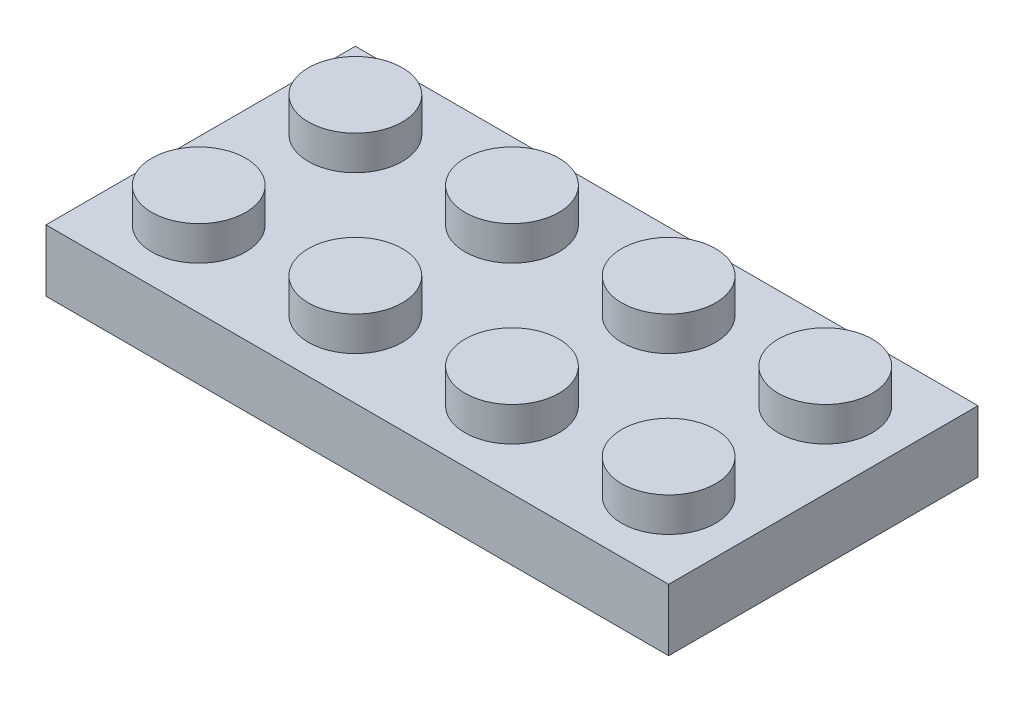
ISO-10303-21;
HEADER;
FILE_DESCRIPTION(('STEP AP214'),'2;1');
FILE_NAME('part.step','',(''),(''),'','','');
FILE_SCHEMA(('AUTOMOTIVE_DESIGN { 1 0 10303 214 1 1 1 1 }'));
ENDSEC;
DATA;
#1=APPLICATION_CONTEXT('core data for automotive mechanical design processes');
#2=APPLICATION_PROTOCOL_DEFINITION('international standard','automotive_design',2000,#1);
#3=PRODUCT_CONTEXT('',#1,'mechanical');
#4=PRODUCT('Part','Part','',(#3));
#5=PRODUCT_RELATED_PRODUCT_CATEGORY('part','',(#4));
#6=PRODUCT_DEFINITION_FORMATION('','',#4);
#7=PRODUCT_DEFINITION_CONTEXT('part definition',#1,'design');
#8=PRODUCT_DEFINITION('design','',#6,#7);
#9=PRODUCT_DEFINITION_SHAPE('','',#8);
#10=(LENGTH_UNIT() NAMED_UNIT(*) SI_UNIT(.MILLI.,.METRE.));
#11=(NAMED_UNIT(*) PLANE_ANGLE_UNIT() SI_UNIT($,.RADIAN.));
#12=(NAMED_UNIT(*) SI_UNIT($,.STERADIAN.) SOLID_ANGLE_UNIT());
#13=UNCERTAINTY_MEASURE_WITH_UNIT(LENGTH_MEASURE(1.E-05),#10,'distance_accuracy_value','');
#14=(GEOMETRIC_REPRESENTATION_CONTEXT(3) GLOBAL_UNCERTAINTY_ASSIGNED_CONTEXT((#13)) GLOBAL_UNIT_ASSIGNED_CONTEXT((#10,
#11,#12)) REPRESENTATION_CONTEXT('',''));
#15=CARTESIAN_POINT('',(0.,0.,0.));
#16=DIRECTION('',(0.,0.,1.));
#17=DIRECTION('',(1.,0.,0.));
#18=AXIS2_PLACEMENT_3D('',#15,#16,#17);
#19=CARTESIAN_POINT('',(-15.4,2.5,7.4));
#20=DIRECTION('',(0.,-1.,0.));
#21=DIRECTION('',(0.,0.,-1.));
#22=AXIS2_PLACEMENT_3D('',#19,#20,#21);
#23=PLANE('',#22);
#24=CARTESIAN_POINT('',(-0.100000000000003,2.5,0.));
#25=DIRECTION('',(0.,-1.,0.));
#26=DIRECTION('',(0.,0.,-1.));
#27=AXIS2_PLACEMENT_3D('',#24,#25,#26);
#28=CIRCLE('',#27,3.4);
#29=CARTESIAN_POINT('',(-0.100000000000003,2.5,-3.4));
#30=VERTEX_POINT('',#29);
#31=EDGE_CURVE('E364',#30,#30,#28,.T.);
#32=ORIENTED_EDGE('',*,*,#31,.F.);
#33=EDGE_LOOP('',(#32));
#34=FACE_BOUND('',#33,.T.);
#35=DIRECTION('',(0.,0.,-1.));
#36=VECTOR('',#35,1.);
#37=CARTESIAN_POINT('',(-15.4,2.5,-7.4));
#38=LINE('',#37,#36);
#39=CARTESIAN_POINT('',(-15.4,2.5,7.4));
#40=VERTEX_POINT('',#39);
#41=CARTESIAN_POINT('',(-15.4,2.5,-7.4));
#42=VERTEX_POINT('',#41);
#43=EDGE_CURVE('E114',#40,#42,#38,.T.);
#44=ORIENTED_EDGE('',*,*,#43,.T.);
#45=DIRECTION('',(1.,0.,0.));
#46=VECTOR('',#45,1.);
#47=CARTESIAN_POINT('',(15.4,2.5,-7.4));
#48=LINE('',#47,#46);
#49=CARTESIAN_POINT('',(15.4,2.5,-7.4));
#50=VERTEX_POINT('',#49);
#51=EDGE_CURVE('E123',#42,#50,#48,.T.);
#52=ORIENTED_EDGE('',*,*,#51,.T.);
#53=DIRECTION('',(0.,0.,1.));
#54=VECTOR('',#53,1.);
#55=CARTESIAN_POINT('',(15.4,2.5,-7.4));
#56=LINE('',#55,#54);
#57=CARTESIAN_POINT('',(15.4,2.5,7.4));
#58=VERTEX_POINT('',#57);
#59=EDGE_CURVE('E128',#50,#58,#56,.T.);
#60=ORIENTED_EDGE('',*,*,#59,.T.);
#61=DIRECTION('',(-1.,0.,0.));
#62=VECTOR('',#61,1.);
#63=CARTESIAN_POINT('',(15.4,2.5,7.4));
#64=LINE('',#63,#62);
#65=EDGE_CURVE('E120',#58,#40,#64,.T.);
#66=ORIENTED_EDGE('',*,*,#65,.T.);
#67=EDGE_LOOP('',(#44,#52,#60,#66));
#68=FACE_BOUND('',#67,.T.);
#69=CARTESIAN_POINT('',(7.9,2.5,0.));
#70=DIRECTION('',(0.,-1.,0.));
#71=DIRECTION('',(0.,0.,-1.));
#72=AXIS2_PLACEMENT_3D('',#69,#70,#71);
#73=CIRCLE('',#72,3.4);
#74=CARTESIAN_POINT('',(7.9,2.5,-3.4));
#75=VERTEX_POINT('',#74);
#76=EDGE_CURVE('E138',#75,#75,#73,.T.);
#77=ORIENTED_EDGE('',*,*,#76,.F.);
#78=EDGE_LOOP('',(#77));
#79=FACE_BOUND('',#78,.T.);
#80=CARTESIAN_POINT('',(-8.1,2.5,0.));
#81=DIRECTION('',(0.,-1.,0.));
#82=DIRECTION('',(0.,0.,-1.));
#83=AXIS2_PLACEMENT_3D('',#80,#81,#82);
#84=CIRCLE('',#83,3.4);
#85=CARTESIAN_POINT('',(-8.1,2.5,-3.4));
#86=VERTEX_POINT('',#85);
#87=EDGE_CURVE('E380',#86,#86,#84,.T.);
#88=ORIENTED_EDGE('',*,*,#87,.F.);
#89=EDGE_LOOP('',(#88));
#90=FACE_BOUND('',#89,.T.);
#91=ADVANCED_FACE('F37',(#34,#68,#79,#90),#23,.T.);
#92=CARTESIAN_POINT('',(-15.9,3.16,-7.9));
#93=DIRECTION('',(0.,1.,0.));
#94=DIRECTION('',(0.,0.,1.));
#95=AXIS2_PLACEMENT_3D('',#92,#93,#94);
#96=PLANE('',#95);
#97=CARTESIAN_POINT('',(-12.,3.16,4.));
#98=DIRECTION('',(0.,1.,0.));
#99=DIRECTION('',(0.,0.,1.));
#100=AXIS2_PLACEMENT_3D('',#97,#98,#99);
#101=CIRCLE('',#100,2.4);
#102=CARTESIAN_POINT('',(-12.,3.16,6.4));
#103=VERTEX_POINT('',#102);
#104=EDGE_CURVE('E195',#103,#103,#101,.T.);
#105=ORIENTED_EDGE('',*,*,#104,.F.);
#106=EDGE_LOOP('',(#105));
#107=FACE_BOUND('',#106,.T.);
#108=CARTESIAN_POINT('',(-4.00000000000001,3.16,4.));
#109=DIRECTION('',(0.,1.,0.));
#110=DIRECTION('',(0.,0.,1.));
#111=AXIS2_PLACEMENT_3D('',#108,#109,#110);
#112=CIRCLE('',#111,2.4);
#113=CARTESIAN_POINT('',(-4.00000000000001,3.16,6.4));
#114=VERTEX_POINT('',#113);
#115=EDGE_CURVE('E189',#114,#114,#112,.T.);
#116=ORIENTED_EDGE('',*,*,#115,.F.);
#117=EDGE_LOOP('',(#116));
#118=FACE_BOUND('',#117,.T.);
#119=CARTESIAN_POINT('',(3.99999999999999,3.16,4.));
#120=DIRECTION('',(0.,1.,0.));
#121=DIRECTION('',(0.,0.,1.));
#122=AXIS2_PLACEMENT_3D('',#119,#120,#121);
#123=CIRCLE('',#122,2.4);
#124=CARTESIAN_POINT('',(3.99999999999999,3.16,6.4));
#125=VERTEX_POINT('',#124);
#126=EDGE_CURVE('E362',#125,#125,#123,.T.);
#127=ORIENTED_EDGE('',*,*,#126,.F.);
#128=EDGE_LOOP('',(#127));
#129=FACE_BOUND('',#128,.T.);
#130=CARTESIAN_POINT('',(12.,3.16,-4.));
#131=DIRECTION('',(0.,1.,0.));
#132=DIRECTION('',(0.,0.,1.));
#133=AXIS2_PLACEMENT_3D('',#130,#131,#132);
#134=CIRCLE('',#133,2.4);
#135=CARTESIAN_POINT('',(12.,3.16,-1.6));
#136=VERTEX_POINT('',#135);
#137=EDGE_CURVE('E158',#136,#136,#134,.T.);
#138=ORIENTED_EDGE('',*,*,#137,.F.);
#139=EDGE_LOOP('',(#138));
#140=FACE_BOUND('',#139,.T.);
#141=DIRECTION('',(0.,0.,1.));
#142=VECTOR('',#141,1.);
#143=CARTESIAN_POINT('',(-15.9,3.16,7.9));
#144=LINE('',#143,#142);
#145=CARTESIAN_POINT('',(-15.9,3.16,-7.9));
#146=VERTEX_POINT('',#145);
#147=CARTESIAN_POINT('',(-15.9,3.16,7.9));
#148=VERTEX_POINT('',#147);
#149=EDGE_CURVE('E167',#146,#148,#144,.T.);
#150=ORIENTED_EDGE('',*,*,#149,.T.);
#151=DIRECTION('',(1.,0.,0.));
#152=VECTOR('',#151,1.);
#153=CARTESIAN_POINT('',(15.9,3.16,7.9));
#154=LINE('',#153,#152);
#155=CARTESIAN_POINT('',(15.9,3.16,7.9));
#156=VERTEX_POINT('',#155);
#157=EDGE_CURVE('E90',#148,#156,#154,.T.);
#158=ORIENTED_EDGE('',*,*,#157,.T.);
#159=DIRECTION('',(0.,0.,-1.));
#160=VECTOR('',#159,1.);
#161=CARTESIAN_POINT('',(15.9,3.16,7.9));
#162=LINE('',#161,#160);
#163=CARTESIAN_POINT('',(15.9,3.16,-7.9));
#164=VERTEX_POINT('',#163);
#165=EDGE_CURVE('E170',#156,#164,#162,.T.);
#166=ORIENTED_EDGE('',*,*,#165,.T.);
#167=DIRECTION('',(-1.,0.,0.));
#168=VECTOR('',#167,1.);
#169=CARTESIAN_POINT('',(15.9,3.16,-7.9));
#170=LINE('',#169,#168);
#171=EDGE_CURVE('E61',#164,#146,#170,.T.);
#172=ORIENTED_EDGE('',*,*,#171,.T.);
#173=EDGE_LOOP('',(#150,#158,#166,#172));
#174=FACE_BOUND('',#173,.T.);
#175=CARTESIAN_POINT('',(12.,3.16,4.));
#176=DIRECTION('',(0.,1.,0.));
#177=DIRECTION('',(0.,0.,1.));
#178=AXIS2_PLACEMENT_3D('',#175,#176,#177);
#179=CIRCLE('',#178,2.4);
#180=CARTESIAN_POINT('',(12.,3.16,6.4));
#181=VERTEX_POINT('',#180);
#182=EDGE_CURVE('E151',#181,#181,#179,.T.);
#183=ORIENTED_EDGE('',*,*,#182,.F.);
#184=EDGE_LOOP('',(#183));
#185=FACE_BOUND('',#184,.T.);
#186=CARTESIAN_POINT('',(3.99999999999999,3.16,-4.));
#187=DIRECTION('',(0.,1.,0.));
#188=DIRECTION('',(0.,0.,1.));
#189=AXIS2_PLACEMENT_3D('',#186,#187,#188);
#190=CIRCLE('',#189,2.4);
#191=CARTESIAN_POINT('',(3.99999999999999,3.16,-1.6));
#192=VERTEX_POINT('',#191);
#193=EDGE_CURVE('E354',#192,#192,#190,.T.);
#194=ORIENTED_EDGE('',*,*,#193,.F.);
#195=EDGE_LOOP('',(#194));
#196=FACE_BOUND('',#195,.T.);
#197=CARTESIAN_POINT('',(-4.00000000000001,3.16,-4.));
#198=DIRECTION('',(0.,1.,0.));
#199=DIRECTION('',(0.,0.,1.));
#200=AXIS2_PLACEMENT_3D('',#197,#198,#199);
#201=CIRCLE('',#200,2.4);
#202=CARTESIAN_POINT('',(-4.00000000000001,3.16,-1.6));
#203=VERTEX_POINT('',#202);
#204=EDGE_CURVE('E201',#203,#203,#201,.T.);
#205=ORIENTED_EDGE('',*,*,#204,.F.);
#206=EDGE_LOOP('',(#205));
#207=FACE_BOUND('',#206,.T.);
#208=CARTESIAN_POINT('',(-12.,3.16,-4.));
#209=DIRECTION('',(0.,1.,0.));
#210=DIRECTION('',(0.,0.,1.));
#211=AXIS2_PLACEMENT_3D('',#208,#209,#210);
#212=CIRCLE('',#211,2.4);
#213=CARTESIAN_POINT('',(-12.,3.16,-1.6));
#214=VERTEX_POINT('',#213);
#215=EDGE_CURVE('E45',#214,#214,#212,.T.);
#216=ORIENTED_EDGE('',*,*,#215,.F.);
#217=EDGE_LOOP('',(#216));
#218=FACE_BOUND('',#217,.T.);
#219=ADVANCED_FACE('F211',(#107,#118,#129,#140,#174,#185,#196,#207,#218),#96,.T.);
#220=CARTESIAN_POINT('',(-15.9,3.16,7.9));
#221=DIRECTION('',(1.,0.,0.));
#222=DIRECTION('',(0.,0.,-1.));
#223=AXIS2_PLACEMENT_3D('',#220,#221,#222);
#224=PLANE('',#223);
#225=DIRECTION('',(0.,0.,1.));
#226=VECTOR('',#225,1.);
#227=CARTESIAN_POINT('',(-15.9,0.,7.9));
#228=LINE('',#227,#226);
#229=CARTESIAN_POINT('',(-15.9,0.,-7.9));
#230=VERTEX_POINT('',#229);
#231=CARTESIAN_POINT('',(-15.9,0.,7.9));
#232=VERTEX_POINT('',#231);
#233=EDGE_CURVE('E164',#230,#232,#228,.T.);
#234=ORIENTED_EDGE('',*,*,#233,.T.);
#235=DIRECTION('',(0.,-1.,0.));
#236=VECTOR('',#235,1.);
#237=CARTESIAN_POINT('',(-15.9,3.16,7.9));
#238=LINE('',#237,#236);
#239=EDGE_CURVE('E187',#148,#232,#238,.T.);
#240=ORIENTED_EDGE('',*,*,#239,.F.);
#241=ORIENTED_EDGE('',*,*,#149,.F.);
#242=DIRECTION('',(0.,-1.,0.));
#243=VECTOR('',#242,1.);
#244=CARTESIAN_POINT('',(-15.9,3.16,-7.9));
#245=LINE('',#244,#243);
#246=EDGE_CURVE('E173',#146,#230,#245,.T.);
#247=ORIENTED_EDGE('',*,*,#246,.T.);
#248=EDGE_LOOP('',(#234,#240,#241,#247));
#249=FACE_BOUND('',#248,.T.);
#250=ADVANCED_FACE('F213',(#249),#224,.F.);
#251=CARTESIAN_POINT('',(15.9,3.16,7.9));
#252=DIRECTION('',(0.,0.,-1.));
#253=DIRECTION('',(-1.,0.,0.));
#254=AXIS2_PLACEMENT_3D('',#251,#252,#253);
#255=PLANE('',#254);
#256=DIRECTION('',(1.,0.,0.));
#257=VECTOR('',#256,1.);
#258=CARTESIAN_POINT('',(15.9,0.,7.9));
#259=LINE('',#258,#257);
#260=CARTESIAN_POINT('',(15.9,0.,7.9));
#261=VERTEX_POINT('',#260);
#262=EDGE_CURVE('E176',#232,#261,#259,.T.);
#263=ORIENTED_EDGE('',*,*,#262,.T.);
#264=DIRECTION('',(0.,-1.,0.));
#265=VECTOR('',#264,1.);
#266=CARTESIAN_POINT('',(15.9,3.16,7.9));
#267=LINE('',#266,#265);
#268=EDGE_CURVE('E184',#156,#261,#267,.T.);
#269=ORIENTED_EDGE('',*,*,#268,.F.);
#270=ORIENTED_EDGE('',*,*,#157,.F.);
#271=ORIENTED_EDGE('',*,*,#239,.T.);
#272=EDGE_LOOP('',(#263,#269,#270,#271));
#273=FACE_BOUND('',#272,.T.);
#274=ADVANCED_FACE('F220',(#273),#255,.F.);
#275=CARTESIAN_POINT('',(15.9,3.16,7.9));
#276=DIRECTION('',(-1.,0.,0.));
#277=DIRECTION('',(0.,0.,1.));
#278=AXIS2_PLACEMENT_3D('',#275,#276,#277);
#279=PLANE('',#278);
#280=DIRECTION('',(0.,0.,-1.));
#281=VECTOR('',#280,1.);
#282=CARTESIAN_POINT('',(15.9,0.,7.9));
#283=LINE('',#282,#281);
#284=CARTESIAN_POINT('',(15.9,0.,-7.9));
#285=VERTEX_POINT('',#284);
#286=EDGE_CURVE('E178',#261,#285,#283,.T.);
#287=ORIENTED_EDGE('',*,*,#286,.T.);
#288=DIRECTION('',(0.,-1.,0.));
#289=VECTOR('',#288,1.);
#290=CARTESIAN_POINT('',(15.9,3.16,-7.9));
#291=LINE('',#290,#289);
#292=EDGE_CURVE('E182',#164,#285,#291,.T.);
#293=ORIENTED_EDGE('',*,*,#292,.F.);
#294=ORIENTED_EDGE('',*,*,#165,.F.);
#295=ORIENTED_EDGE('',*,*,#268,.T.);
#296=EDGE_LOOP('',(#287,#293,#294,#295));
#297=FACE_BOUND('',#296,.T.);
#298=ADVANCED_FACE('F238',(#297),#279,.F.);
#299=CARTESIAN_POINT('',(15.9,3.16,-7.9));
#300=DIRECTION('',(0.,0.,1.));
#301=DIRECTION('',(1.,0.,0.));
#302=AXIS2_PLACEMENT_3D('',#299,#300,#301);
#303=PLANE('',#302);
#304=DIRECTION('',(-1.,0.,0.));
#305=VECTOR('',#304,1.);
#306=CARTESIAN_POINT('',(15.9,0.,-7.9));
#307=LINE('',#306,#305);
#308=EDGE_CURVE('E82',#285,#230,#307,.T.);
#309=ORIENTED_EDGE('',*,*,#308,.T.);
#310=ORIENTED_EDGE('',*,*,#246,.F.);
#311=ORIENTED_EDGE('',*,*,#171,.F.);
#312=ORIENTED_EDGE('',*,*,#292,.T.);
#313=EDGE_LOOP('',(#309,#310,#311,#312));
#314=FACE_BOUND('',#313,.T.);
#315=ADVANCED_FACE('F234',(#314),#303,.F.);
#316=CARTESIAN_POINT('',(-15.9,0.,-7.9));
#317=DIRECTION('',(0.,1.,0.));
#318=DIRECTION('',(0.,0.,1.));
#319=AXIS2_PLACEMENT_3D('',#316,#317,#318);
#320=PLANE('',#319);
#321=DIRECTION('',(1.,0.,0.));
#322=VECTOR('',#321,1.);
#323=CARTESIAN_POINT('',(15.4,0.,-7.4));
#324=LINE('',#323,#322);
#325=CARTESIAN_POINT('',(-15.4,0.,-7.4));
#326=VERTEX_POINT('',#325);
#327=CARTESIAN_POINT('',(15.4,0.,-7.4));
#328=VERTEX_POINT('',#327);
#329=EDGE_CURVE('E144',#326,#328,#324,.T.);
#330=ORIENTED_EDGE('',*,*,#329,.F.);
#331=DIRECTION('',(0.,0.,-1.));
#332=VECTOR('',#331,1.);
#333=CARTESIAN_POINT('',(-15.4,0.,-7.4));
#334=LINE('',#333,#332);
#335=CARTESIAN_POINT('',(-15.4,0.,7.4));
#336=VERTEX_POINT('',#335);
#337=EDGE_CURVE('E52',#336,#326,#334,.T.);
#338=ORIENTED_EDGE('',*,*,#337,.F.);
#339=DIRECTION('',(-1.,0.,0.));
#340=VECTOR('',#339,1.);
#341=CARTESIAN_POINT('',(15.4,0.,7.4));
#342=LINE('',#341,#340);
#343=CARTESIAN_POINT('',(15.4,0.,7.4));
#344=VERTEX_POINT('',#343);
#345=EDGE_CURVE('E132',#344,#336,#342,.T.);
#346=ORIENTED_EDGE('',*,*,#345,.F.);
#347=DIRECTION('',(0.,0.,1.));
#348=VECTOR('',#347,1.);
#349=CARTESIAN_POINT('',(15.4,0.,-7.4));
#350=LINE('',#349,#348);
#351=EDGE_CURVE('E135',#328,#344,#350,.T.);
#352=ORIENTED_EDGE('',*,*,#351,.F.);
#353=EDGE_LOOP('',(#330,#338,#346,#352));
#354=FACE_BOUND('',#353,.T.);
#355=ORIENTED_EDGE('',*,*,#233,.F.);
#356=ORIENTED_EDGE('',*,*,#308,.F.);
#357=ORIENTED_EDGE('',*,*,#286,.F.);
#358=ORIENTED_EDGE('',*,*,#262,.F.);
#359=EDGE_LOOP('',(#355,#356,#357,#358));
#360=FACE_BOUND('',#359,.T.);
#361=ADVANCED_FACE('F231',(#354,#360),#320,.F.);
#362=CARTESIAN_POINT('',(12.,4.91,-4.));
#363=DIRECTION('',(0.,-1.,0.));
#364=DIRECTION('',(0.,0.,-1.));
#365=AXIS2_PLACEMENT_3D('',#362,#363,#364);
#366=CYLINDRICAL_SURFACE('',#365,2.4);
#367=CARTESIAN_POINT('',(12.,4.91,-4.));
#368=DIRECTION('',(0.,1.,0.));
#369=DIRECTION('',(0.,0.,1.));
#370=AXIS2_PLACEMENT_3D('',#367,#368,#369);
#371=CIRCLE('',#370,2.4);
#372=CARTESIAN_POINT('',(12.,4.91,-1.6));
#373=VERTEX_POINT('',#372);
#374=EDGE_CURVE('E161',#373,#373,#371,.T.);
#375=ORIENTED_EDGE('',*,*,#374,.F.);
#376=EDGE_LOOP('',(#375));
#377=FACE_BOUND('',#376,.T.);
#378=ORIENTED_EDGE('',*,*,#137,.T.);
#379=EDGE_LOOP('',(#378));
#380=FACE_BOUND('',#379,.T.);
#381=ADVANCED_FACE('F229',(#377,#380),#366,.T.);
#382=CARTESIAN_POINT('',(12.,4.91,-4.));
#383=DIRECTION('',(0.,1.,0.));
#384=DIRECTION('',(0.,0.,1.));
#385=AXIS2_PLACEMENT_3D('',#382,#383,#384);
#386=PLANE('',#385);
#387=ORIENTED_EDGE('',*,*,#374,.T.);
#388=EDGE_LOOP('',(#387));
#389=FACE_BOUND('',#388,.T.);
#390=ADVANCED_FACE('F334',(#389),#386,.T.);
#391=CARTESIAN_POINT('',(12.,4.91,4.));
#392=DIRECTION('',(0.,-1.,0.));
#393=DIRECTION('',(0.,0.,-1.));
#394=AXIS2_PLACEMENT_3D('',#391,#392,#393);
#395=CYLINDRICAL_SURFACE('',#394,2.4);
#396=CARTESIAN_POINT('',(12.,4.91,4.));
#397=DIRECTION('',(0.,1.,0.));
#398=DIRECTION('',(0.,0.,1.));
#399=AXIS2_PLACEMENT_3D('',#396,#397,#398);
#400=CIRCLE('',#399,2.4);
#401=CARTESIAN_POINT('',(12.,4.91,6.4));
#402=VERTEX_POINT('',#401);
#403=EDGE_CURVE('E155',#402,#402,#400,.T.);
#404=ORIENTED_EDGE('',*,*,#403,.F.);
#405=EDGE_LOOP('',(#404));
#406=FACE_BOUND('',#405,.T.);
#407=ORIENTED_EDGE('',*,*,#182,.T.);
#408=EDGE_LOOP('',(#407));
#409=FACE_BOUND('',#408,.T.);
#410=ADVANCED_FACE('F331',(#406,#409),#395,.T.);
#411=CARTESIAN_POINT('',(12.,4.91,4.));
#412=DIRECTION('',(0.,1.,0.));
#413=DIRECTION('',(0.,0.,1.));
#414=AXIS2_PLACEMENT_3D('',#411,#412,#413);
#415=PLANE('',#414);
#416=ORIENTED_EDGE('',*,*,#403,.T.);
#417=EDGE_LOOP('',(#416));
#418=FACE_BOUND('',#417,.T.);
#419=ADVANCED_FACE('F328',(#418),#415,.T.);
#420=CARTESIAN_POINT('',(-15.4,2.5,-7.4));
#421=DIRECTION('',(-1.,0.,0.));
#422=DIRECTION('',(0.,0.,1.));
#423=AXIS2_PLACEMENT_3D('',#420,#421,#422);
#424=PLANE('',#423);
#425=ORIENTED_EDGE('',*,*,#337,.T.);
#426=DIRECTION('',(0.,-1.,0.));
#427=VECTOR('',#426,1.);
#428=CARTESIAN_POINT('',(-15.4,2.5,-7.4));
#429=LINE('',#428,#427);
#430=EDGE_CURVE('E110',#42,#326,#429,.T.);
#431=ORIENTED_EDGE('',*,*,#430,.F.);
#432=ORIENTED_EDGE('',*,*,#43,.F.);
#433=DIRECTION('',(0.,-1.,0.));
#434=VECTOR('',#433,1.);
#435=CARTESIAN_POINT('',(-15.4,2.5,7.4));
#436=LINE('',#435,#434);
#437=EDGE_CURVE('E149',#40,#336,#436,.T.);
#438=ORIENTED_EDGE('',*,*,#437,.T.);
#439=EDGE_LOOP('',(#425,#431,#432,#438));
#440=FACE_BOUND('',#439,.T.);
#441=ADVANCED_FACE('F112',(#440),#424,.F.);
#442=CARTESIAN_POINT('',(15.4,2.5,7.4));
#443=DIRECTION('',(0.,0.,1.));
#444=DIRECTION('',(1.,0.,0.));
#445=AXIS2_PLACEMENT_3D('',#442,#443,#444);
#446=PLANE('',#445);
#447=ORIENTED_EDGE('',*,*,#345,.T.);
#448=ORIENTED_EDGE('',*,*,#437,.F.);
#449=ORIENTED_EDGE('',*,*,#65,.F.);
#450=DIRECTION('',(0.,-1.,0.));
#451=VECTOR('',#450,1.);
#452=CARTESIAN_POINT('',(15.4,2.5,7.4));
#453=LINE('',#452,#451);
#454=EDGE_CURVE('E152',#58,#344,#453,.T.);
#455=ORIENTED_EDGE('',*,*,#454,.T.);
#456=EDGE_LOOP('',(#447,#448,#449,#455));
#457=FACE_BOUND('',#456,.T.);
#458=ADVANCED_FACE('F316',(#457),#446,.F.);
#459=CARTESIAN_POINT('',(15.4,2.5,-7.4));
#460=DIRECTION('',(1.,0.,0.));
#461=DIRECTION('',(0.,0.,-1.));
#462=AXIS2_PLACEMENT_3D('',#459,#460,#461);
#463=PLANE('',#462);
#464=ORIENTED_EDGE('',*,*,#351,.T.);
#465=ORIENTED_EDGE('',*,*,#454,.F.);
#466=ORIENTED_EDGE('',*,*,#59,.F.);
#467=DIRECTION('',(0.,-1.,0.));
#468=VECTOR('',#467,1.);
#469=CARTESIAN_POINT('',(15.4,2.5,-7.4));
#470=LINE('',#469,#468);
#471=EDGE_CURVE('E119',#50,#328,#470,.T.);
#472=ORIENTED_EDGE('',*,*,#471,.T.);
#473=EDGE_LOOP('',(#464,#465,#466,#472));
#474=FACE_BOUND('',#473,.T.);
#475=ADVANCED_FACE('F319',(#474),#463,.F.);
#476=CARTESIAN_POINT('',(15.4,2.5,-7.4));
#477=DIRECTION('',(0.,0.,-1.));
#478=DIRECTION('',(-1.,0.,0.));
#479=AXIS2_PLACEMENT_3D('',#476,#477,#478);
#480=PLANE('',#479);
#481=ORIENTED_EDGE('',*,*,#329,.T.);
#482=ORIENTED_EDGE('',*,*,#471,.F.);
#483=ORIENTED_EDGE('',*,*,#51,.F.);
#484=ORIENTED_EDGE('',*,*,#430,.T.);
#485=EDGE_LOOP('',(#481,#482,#483,#484));
#486=FACE_BOUND('',#485,.T.);
#487=ADVANCED_FACE('F124',(#486),#480,.F.);
#488=CARTESIAN_POINT('',(7.9,0.,0.));
#489=DIRECTION('',(0.,1.,0.));
#490=DIRECTION('',(0.,0.,1.));
#491=AXIS2_PLACEMENT_3D('',#488,#489,#490);
#492=CYLINDRICAL_SURFACE('',#491,3.4);
#493=CARTESIAN_POINT('',(7.9,0.,0.));
#494=DIRECTION('',(0.,-1.,0.));
#495=DIRECTION('',(0.,0.,-1.));
#496=AXIS2_PLACEMENT_3D('',#493,#494,#495);
#497=CIRCLE('',#496,3.4);
#498=CARTESIAN_POINT('',(7.9,0.,-3.4));
#499=VERTEX_POINT('',#498);
#500=EDGE_CURVE('E145',#499,#499,#497,.T.);
#501=ORIENTED_EDGE('',*,*,#500,.F.);
#502=EDGE_LOOP('',(#501));
#503=FACE_BOUND('',#502,.T.);
#504=ORIENTED_EDGE('',*,*,#76,.T.);
#505=EDGE_LOOP('',(#504));
#506=FACE_BOUND('',#505,.T.);
#507=ADVANCED_FACE('F311',(#503,#506),#492,.T.);
#508=CARTESIAN_POINT('',(7.9,0.,0.));
#509=DIRECTION('',(0.,-1.,0.));
#510=DIRECTION('',(0.,0.,-1.));
#511=AXIS2_PLACEMENT_3D('',#508,#509,#510);
#512=PLANE('',#511);
#513=ORIENTED_EDGE('',*,*,#500,.T.);
#514=EDGE_LOOP('',(#513));
#515=FACE_BOUND('',#514,.T.);
#516=ADVANCED_FACE('F305',(#515),#512,.T.);
#517=CARTESIAN_POINT('',(3.99999999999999,4.91,4.));
#518=DIRECTION('',(0.,-1.,0.));
#519=DIRECTION('',(0.,0.,-1.));
#520=AXIS2_PLACEMENT_3D('',#517,#518,#519);
#521=CYLINDRICAL_SURFACE('',#520,2.4);
#522=CARTESIAN_POINT('',(3.99999999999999,4.91,4.));
#523=DIRECTION('',(0.,1.,0.));
#524=DIRECTION('',(0.,0.,1.));
#525=AXIS2_PLACEMENT_3D('',#522,#523,#524);
#526=CIRCLE('',#525,2.4);
#527=CARTESIAN_POINT('',(3.99999999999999,4.91,6.4));
#528=VERTEX_POINT('',#527);
#529=EDGE_CURVE('E370',#528,#528,#526,.T.);
#530=ORIENTED_EDGE('',*,*,#529,.F.);
#531=EDGE_LOOP('',(#530));
#532=FACE_BOUND('',#531,.T.);
#533=ORIENTED_EDGE('',*,*,#126,.T.);
#534=EDGE_LOOP('',(#533));
#535=FACE_BOUND('',#534,.T.);
#536=ADVANCED_FACE('F254',(#532,#535),#521,.T.);
#537=CARTESIAN_POINT('',(3.99999999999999,4.91,4.));
#538=DIRECTION('',(0.,1.,0.));
#539=DIRECTION('',(0.,0.,1.));
#540=AXIS2_PLACEMENT_3D('',#537,#538,#539);
#541=PLANE('',#540);
#542=ORIENTED_EDGE('',*,*,#529,.T.);
#543=EDGE_LOOP('',(#542));
#544=FACE_BOUND('',#543,.T.);
#545=ADVANCED_FACE('F252',(#544),#541,.T.);
#546=CARTESIAN_POINT('',(-4.00000000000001,4.91,4.));
#547=DIRECTION('',(0.,1.,0.));
#548=DIRECTION('',(0.,0.,1.));
#549=AXIS2_PLACEMENT_3D('',#546,#547,#548);
#550=PLANE('',#549);
#551=CARTESIAN_POINT('',(-4.00000000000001,4.91,4.));
#552=DIRECTION('',(0.,1.,0.));
#553=DIRECTION('',(0.,0.,1.));
#554=AXIS2_PLACEMENT_3D('',#551,#552,#553);
#555=CIRCLE('',#554,2.4);
#556=CARTESIAN_POINT('',(-4.00000000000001,4.91,6.4));
#557=VERTEX_POINT('',#556);
#558=EDGE_CURVE('E192',#557,#557,#555,.T.);
#559=ORIENTED_EDGE('',*,*,#558,.T.);
#560=EDGE_LOOP('',(#559));
#561=FACE_BOUND('',#560,.T.);
#562=ADVANCED_FACE('F248',(#561),#550,.T.);
#563=CARTESIAN_POINT('',(-4.00000000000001,4.91,4.));
#564=DIRECTION('',(0.,-1.,0.));
#565=DIRECTION('',(0.,0.,-1.));
#566=AXIS2_PLACEMENT_3D('',#563,#564,#565);
#567=CYLINDRICAL_SURFACE('',#566,2.4);
#568=ORIENTED_EDGE('',*,*,#558,.F.);
#569=EDGE_LOOP('',(#568));
#570=FACE_BOUND('',#569,.T.);
#571=ORIENTED_EDGE('',*,*,#115,.T.);
#572=EDGE_LOOP('',(#571));
#573=FACE_BOUND('',#572,.T.);
#574=ADVANCED_FACE('F244',(#570,#573),#567,.T.);
#575=CARTESIAN_POINT('',(-12.,4.91,4.));
#576=DIRECTION('',(0.,1.,0.));
#577=DIRECTION('',(0.,0.,1.));
#578=AXIS2_PLACEMENT_3D('',#575,#576,#577);
#579=PLANE('',#578);
#580=CARTESIAN_POINT('',(-12.,4.91,4.));
#581=DIRECTION('',(0.,1.,0.));
#582=DIRECTION('',(0.,0.,1.));
#583=AXIS2_PLACEMENT_3D('',#580,#581,#582);
#584=CIRCLE('',#583,2.4);
#585=CARTESIAN_POINT('',(-12.,4.91,6.4));
#586=VERTEX_POINT('',#585);
#587=EDGE_CURVE('E198',#586,#586,#584,.T.);
#588=ORIENTED_EDGE('',*,*,#587,.T.);
#589=EDGE_LOOP('',(#588));
#590=FACE_BOUND('',#589,.T.);
#591=ADVANCED_FACE('F247',(#590),#579,.T.);
#592=CARTESIAN_POINT('',(-12.,4.91,4.));
#593=DIRECTION('',(0.,-1.,0.));
#594=DIRECTION('',(0.,0.,-1.));
#595=AXIS2_PLACEMENT_3D('',#592,#593,#594);
#596=CYLINDRICAL_SURFACE('',#595,2.4);
#597=ORIENTED_EDGE('',*,*,#587,.F.);
#598=EDGE_LOOP('',(#597));
#599=FACE_BOUND('',#598,.T.);
#600=ORIENTED_EDGE('',*,*,#104,.T.);
#601=EDGE_LOOP('',(#600));
#602=FACE_BOUND('',#601,.T.);
#603=ADVANCED_FACE('F255',(#599,#602),#596,.T.);
#604=CARTESIAN_POINT('',(3.99999999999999,4.91,-4.));
#605=DIRECTION('',(0.,-1.,0.));
#606=DIRECTION('',(0.,0.,-1.));
#607=AXIS2_PLACEMENT_3D('',#604,#605,#606);
#608=CYLINDRICAL_SURFACE('',#607,2.4);
#609=CARTESIAN_POINT('',(3.99999999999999,4.91,-4.));
#610=DIRECTION('',(0.,1.,0.));
#611=DIRECTION('',(0.,0.,1.));
#612=AXIS2_PLACEMENT_3D('',#609,#610,#611);
#613=CIRCLE('',#612,2.4);
#614=CARTESIAN_POINT('',(3.99999999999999,4.91,-1.6));
#615=VERTEX_POINT('',#614);
#616=EDGE_CURVE('E358',#615,#615,#613,.T.);
#617=ORIENTED_EDGE('',*,*,#616,.F.);
#618=EDGE_LOOP('',(#617));
#619=FACE_BOUND('',#618,.T.);
#620=ORIENTED_EDGE('',*,*,#193,.T.);
#621=EDGE_LOOP('',(#620));
#622=FACE_BOUND('',#621,.T.);
#623=ADVANCED_FACE('F258',(#619,#622),#608,.T.);
#624=CARTESIAN_POINT('',(3.99999999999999,4.91,-4.));
#625=DIRECTION('',(0.,1.,0.));
#626=DIRECTION('',(0.,0.,1.));
#627=AXIS2_PLACEMENT_3D('',#624,#625,#626);
#628=PLANE('',#627);
#629=ORIENTED_EDGE('',*,*,#616,.T.);
#630=EDGE_LOOP('',(#629));
#631=FACE_BOUND('',#630,.T.);
#632=ADVANCED_FACE('F260',(#631),#628,.T.);
#633=CARTESIAN_POINT('',(-4.00000000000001,4.91,-4.));
#634=DIRECTION('',(0.,1.,0.));
#635=DIRECTION('',(0.,0.,1.));
#636=AXIS2_PLACEMENT_3D('',#633,#634,#635);
#637=PLANE('',#636);
#638=CARTESIAN_POINT('',(-4.00000000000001,4.91,-4.));
#639=DIRECTION('',(0.,1.,0.));
#640=DIRECTION('',(0.,0.,1.));
#641=AXIS2_PLACEMENT_3D('',#638,#639,#640);
#642=CIRCLE('',#641,2.4);
#643=CARTESIAN_POINT('',(-4.00000000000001,4.91,-1.6));
#644=VERTEX_POINT('',#643);
#645=EDGE_CURVE('E204',#644,#644,#642,.T.);
#646=ORIENTED_EDGE('',*,*,#645,.T.);
#647=EDGE_LOOP('',(#646));
#648=FACE_BOUND('',#647,.T.);
#649=ADVANCED_FACE('F267',(#648),#637,.T.);
#650=CARTESIAN_POINT('',(-4.00000000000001,4.91,-4.));
#651=DIRECTION('',(0.,-1.,0.));
#652=DIRECTION('',(0.,0.,-1.));
#653=AXIS2_PLACEMENT_3D('',#650,#651,#652);
#654=CYLINDRICAL_SURFACE('',#653,2.4);
#655=ORIENTED_EDGE('',*,*,#645,.F.);
#656=EDGE_LOOP('',(#655));
#657=FACE_BOUND('',#656,.T.);
#658=ORIENTED_EDGE('',*,*,#204,.T.);
#659=EDGE_LOOP('',(#658));
#660=FACE_BOUND('',#659,.T.);
#661=ADVANCED_FACE('F264',(#657,#660),#654,.T.);
#662=CARTESIAN_POINT('',(-12.,4.91,-4.));
#663=DIRECTION('',(0.,1.,0.));
#664=DIRECTION('',(0.,0.,1.));
#665=AXIS2_PLACEMENT_3D('',#662,#663,#664);
#666=PLANE('',#665);
#667=CARTESIAN_POINT('',(-12.,4.91,-4.));
#668=DIRECTION('',(0.,1.,0.));
#669=DIRECTION('',(0.,0.,1.));
#670=AXIS2_PLACEMENT_3D('',#667,#668,#669);
#671=CIRCLE('',#670,2.4);
#672=CARTESIAN_POINT('',(-12.,4.91,-1.6));
#673=VERTEX_POINT('',#672);
#674=EDGE_CURVE('E11',#673,#673,#671,.T.);
#675=ORIENTED_EDGE('',*,*,#674,.T.);
#676=EDGE_LOOP('',(#675));
#677=FACE_BOUND('',#676,.T.);
#678=ADVANCED_FACE('F39',(#677),#666,.T.);
#679=CARTESIAN_POINT('',(-12.,4.91,-4.));
#680=DIRECTION('',(0.,-1.,0.));
#681=DIRECTION('',(0.,0.,-1.));
#682=AXIS2_PLACEMENT_3D('',#679,#680,#681);
#683=CYLINDRICAL_SURFACE('',#682,2.4);
#684=ORIENTED_EDGE('',*,*,#674,.F.);
#685=EDGE_LOOP('',(#684));
#686=FACE_BOUND('',#685,.T.);
#687=ORIENTED_EDGE('',*,*,#215,.T.);
#688=EDGE_LOOP('',(#687));
#689=FACE_BOUND('',#688,.T.);
#690=ADVANCED_FACE('F209',(#686,#689),#683,.T.);
#691=CARTESIAN_POINT('',(-0.100000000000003,0.,0.));
#692=DIRECTION('',(0.,1.,0.));
#693=DIRECTION('',(0.,0.,1.));
#694=AXIS2_PLACEMENT_3D('',#691,#692,#693);
#695=CYLINDRICAL_SURFACE('',#694,3.4);
#696=CARTESIAN_POINT('',(-0.100000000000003,0.,0.));
#697=DIRECTION('',(0.,-1.,0.));
#698=DIRECTION('',(0.,0.,-1.));
#699=AXIS2_PLACEMENT_3D('',#696,#697,#698);
#700=CIRCLE('',#699,3.4);
#701=CARTESIAN_POINT('',(-0.100000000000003,0.,-3.4));
#702=VERTEX_POINT('',#701);
#703=EDGE_CURVE('E359',#702,#702,#700,.T.);
#704=ORIENTED_EDGE('',*,*,#703,.F.);
#705=EDGE_LOOP('',(#704));
#706=FACE_BOUND('',#705,.T.);
#707=ORIENTED_EDGE('',*,*,#31,.T.);
#708=EDGE_LOOP('',(#707));
#709=FACE_BOUND('',#708,.T.);
#710=ADVANCED_FACE('F272',(#706,#709),#695,.T.);
#711=CARTESIAN_POINT('',(-0.100000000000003,0.,0.));
#712=DIRECTION('',(0.,-1.,0.));
#713=DIRECTION('',(0.,0.,-1.));
#714=AXIS2_PLACEMENT_3D('',#711,#712,#713);
#715=PLANE('',#714);
#716=ORIENTED_EDGE('',*,*,#703,.T.);
#717=EDGE_LOOP('',(#716));
#718=FACE_BOUND('',#717,.T.);
#719=ADVANCED_FACE('F274',(#718),#715,.T.);
#720=CARTESIAN_POINT('',(-8.1,0.,0.));
#721=DIRECTION('',(0.,1.,0.));
#722=DIRECTION('',(0.,0.,1.));
#723=AXIS2_PLACEMENT_3D('',#720,#721,#722);
#724=CYLINDRICAL_SURFACE('',#723,3.4);
#725=CARTESIAN_POINT('',(-8.1,0.,0.));
#726=DIRECTION('',(0.,-1.,0.));
#727=DIRECTION('',(0.,0.,-1.));
#728=AXIS2_PLACEMENT_3D('',#725,#726,#727);
#729=CIRCLE('',#728,3.4);
#730=CARTESIAN_POINT('',(-8.1,0.,-3.4));
#731=VERTEX_POINT('',#730);
#732=EDGE_CURVE('E382',#731,#731,#729,.T.);
#733=ORIENTED_EDGE('',*,*,#732,.F.);
#734=EDGE_LOOP('',(#733));
#735=FACE_BOUND('',#734,.T.);
#736=ORIENTED_EDGE('',*,*,#87,.T.);
#737=EDGE_LOOP('',(#736));
#738=FACE_BOUND('',#737,.T.);
#739=ADVANCED_FACE('F285',(#735,#738),#724,.T.);
#740=CARTESIAN_POINT('',(-8.1,0.,0.));
#741=DIRECTION('',(0.,-1.,0.));
#742=DIRECTION('',(0.,0.,-1.));
#743=AXIS2_PLACEMENT_3D('',#740,#741,#742);
#744=PLANE('',#743);
#745=ORIENTED_EDGE('',*,*,#732,.T.);
#746=EDGE_LOOP('',(#745));
#747=FACE_BOUND('',#746,.T.);
#748=ADVANCED_FACE('F281',(#747),#744,.T.);
#749=CLOSED_SHELL('',(#91,#219,#250,#274,#298,#315,#361,#381,#390,#410,#419,#441,#458,#475,#487,
#507,#516,#536,#545,#562,#574,#591,#603,#623,#632,#649,#661,#678,#690,#710,#719,#739,#748));
#750=MANIFOLD_SOLID_BREP('B2',#749);
#751=ADVANCED_BREP_SHAPE_REPRESENTATION('',(#18,#750),#14);
#752=SHAPE_DEFINITION_REPRESENTATION(#9,#751);
ENDSEC;
END-ISO-10303-21;
